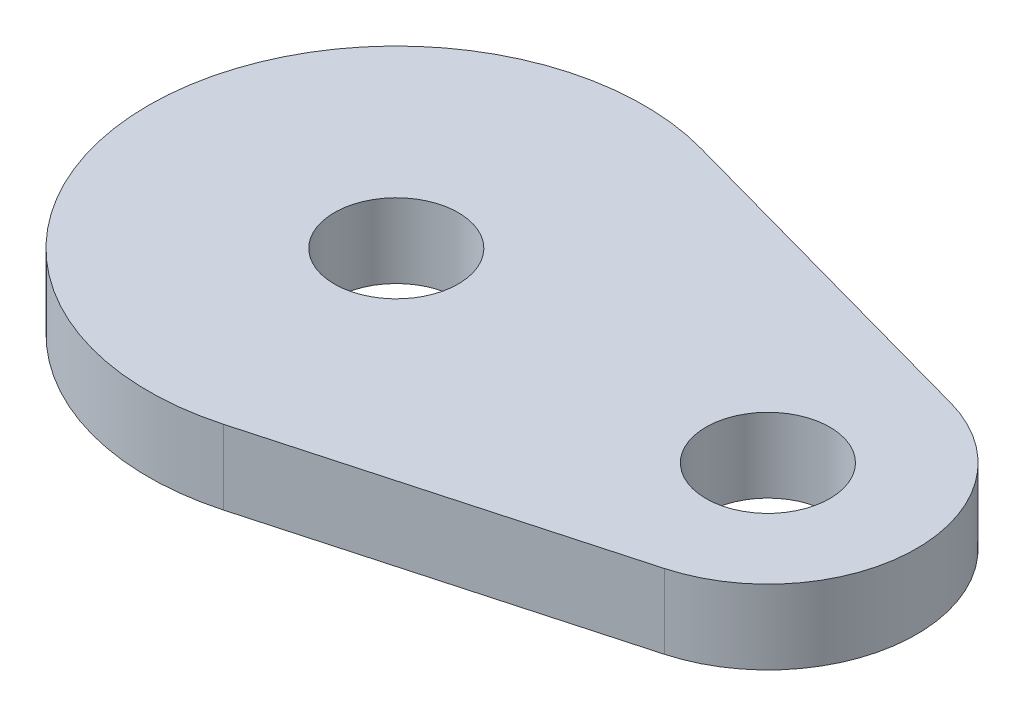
ISO-10303-21;
HEADER;
FILE_DESCRIPTION(('STEP AP214'),'2;1');
FILE_NAME('part.step','',(''),(''),'','','');
FILE_SCHEMA(('AUTOMOTIVE_DESIGN { 1 0 10303 214 1 1 1 1 }'));
ENDSEC;
DATA;
#1=APPLICATION_CONTEXT('core data for automotive mechanical design processes');
#2=APPLICATION_PROTOCOL_DEFINITION('international standard','automotive_design',2000,#1);
#3=PRODUCT_CONTEXT('',#1,'mechanical');
#4=PRODUCT('Part','Part','',(#3));
#5=PRODUCT_RELATED_PRODUCT_CATEGORY('part','',(#4));
#6=PRODUCT_DEFINITION_FORMATION('','',#4);
#7=PRODUCT_DEFINITION_CONTEXT('part definition',#1,'design');
#8=PRODUCT_DEFINITION('design','',#6,#7);
#9=PRODUCT_DEFINITION_SHAPE('','',#8);
#10=(LENGTH_UNIT() NAMED_UNIT(*) SI_UNIT(.MILLI.,.METRE.));
#11=(NAMED_UNIT(*) PLANE_ANGLE_UNIT() SI_UNIT($,.RADIAN.));
#12=(NAMED_UNIT(*) SI_UNIT($,.STERADIAN.) SOLID_ANGLE_UNIT());
#13=UNCERTAINTY_MEASURE_WITH_UNIT(LENGTH_MEASURE(1.E-05),#10,'distance_accuracy_value','');
#14=(GEOMETRIC_REPRESENTATION_CONTEXT(3) GLOBAL_UNCERTAINTY_ASSIGNED_CONTEXT((#13)) GLOBAL_UNIT_ASSIGNED_CONTEXT((#10,
#11,#12)) REPRESENTATION_CONTEXT('',''));
#15=CARTESIAN_POINT('',(0.,0.,0.));
#16=DIRECTION('',(0.,0.,1.));
#17=DIRECTION('',(1.,0.,0.));
#18=AXIS2_PLACEMENT_3D('',#15,#16,#17);
#19=CARTESIAN_POINT('',(0.,3.,0.));
#20=DIRECTION('',(0.,1.,0.));
#21=DIRECTION('',(0.,0.,1.));
#22=AXIS2_PLACEMENT_3D('',#19,#20,#21);
#23=PLANE('',#22);
#24=CARTESIAN_POINT('',(15.,3.,0.));
#25=DIRECTION('',(0.,1.,0.));
#26=DIRECTION('',(0.,0.,1.));
#27=AXIS2_PLACEMENT_3D('',#24,#25,#26);
#28=CIRCLE('',#27,2.5);
#29=CARTESIAN_POINT('',(15.,3.,2.5));
#30=VERTEX_POINT('',#29);
#31=EDGE_CURVE('E91',#30,#30,#28,.T.);
#32=ORIENTED_EDGE('',*,*,#31,.F.);
#33=EDGE_LOOP('',(#32));
#34=FACE_BOUND('',#33,.T.);
#35=CARTESIAN_POINT('',(0.,3.,0.));
#36=DIRECTION('',(0.,1.,0.));
#37=DIRECTION('',(0.,0.,1.));
#38=AXIS2_PLACEMENT_3D('',#35,#36,#37);
#39=CIRCLE('',#38,10.);
#40=CARTESIAN_POINT('',(2.66666666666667,3.,-9.63788819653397));
#41=VERTEX_POINT('',#40);
#42=CARTESIAN_POINT('',(2.66666666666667,3.,9.63788819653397));
#43=VERTEX_POINT('',#42);
#44=EDGE_CURVE('E101',#41,#43,#39,.T.);
#45=ORIENTED_EDGE('',*,*,#44,.T.);
#46=DIRECTION('',(0.963788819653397,0.,-0.266666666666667));
#47=VECTOR('',#46,1.);
#48=CARTESIAN_POINT('',(2.66666666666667,3.,9.63788819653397));
#49=LINE('',#48,#47);
#50=CARTESIAN_POINT('',(16.6,3.,5.78273291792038));
#51=VERTEX_POINT('',#50);
#52=EDGE_CURVE('E86',#43,#51,#49,.T.);
#53=ORIENTED_EDGE('',*,*,#52,.T.);
#54=CARTESIAN_POINT('',(15.,3.,0.));
#55=DIRECTION('',(0.,1.,0.));
#56=DIRECTION('',(0.,0.,1.));
#57=AXIS2_PLACEMENT_3D('',#54,#55,#56);
#58=CIRCLE('',#57,6.);
#59=CARTESIAN_POINT('',(16.6,3.,-5.78273291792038));
#60=VERTEX_POINT('',#59);
#61=EDGE_CURVE('E52',#51,#60,#58,.T.);
#62=ORIENTED_EDGE('',*,*,#61,.T.);
#63=DIRECTION('',(-0.963788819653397,0.,-0.266666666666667));
#64=VECTOR('',#63,1.);
#65=CARTESIAN_POINT('',(2.66666666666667,3.,-9.63788819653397));
#66=LINE('',#65,#64);
#67=EDGE_CURVE('E47',#60,#41,#66,.T.);
#68=ORIENTED_EDGE('',*,*,#67,.T.);
#69=EDGE_LOOP('',(#45,#53,#62,#68));
#70=FACE_BOUND('',#69,.T.);
#71=CARTESIAN_POINT('',(0.,3.,0.));
#72=DIRECTION('',(0.,1.,0.));
#73=DIRECTION('',(0.,0.,1.));
#74=AXIS2_PLACEMENT_3D('',#71,#72,#73);
#75=CIRCLE('',#74,2.5);
#76=CARTESIAN_POINT('',(0.,3.,2.5));
#77=VERTEX_POINT('',#76);
#78=EDGE_CURVE('E119',#77,#77,#75,.T.);
#79=ORIENTED_EDGE('',*,*,#78,.F.);
#80=EDGE_LOOP('',(#79));
#81=FACE_BOUND('',#80,.T.);
#82=ADVANCED_FACE('F32',(#34,#70,#81),#23,.T.);
#83=CARTESIAN_POINT('',(0.,0.,0.));
#84=DIRECTION('',(0.,1.,0.));
#85=DIRECTION('',(0.,0.,1.));
#86=AXIS2_PLACEMENT_3D('',#83,#84,#85);
#87=PLANE('',#86);
#88=CARTESIAN_POINT('',(15.,0.,0.));
#89=DIRECTION('',(0.,1.,0.));
#90=DIRECTION('',(0.,0.,1.));
#91=AXIS2_PLACEMENT_3D('',#88,#89,#90);
#92=CIRCLE('',#91,2.5);
#93=CARTESIAN_POINT('',(15.,0.,2.5));
#94=VERTEX_POINT('',#93);
#95=EDGE_CURVE('E94',#94,#94,#92,.T.);
#96=ORIENTED_EDGE('',*,*,#95,.T.);
#97=EDGE_LOOP('',(#96));
#98=FACE_BOUND('',#97,.T.);
#99=CARTESIAN_POINT('',(0.,0.,0.));
#100=DIRECTION('',(0.,1.,0.));
#101=DIRECTION('',(0.,0.,1.));
#102=AXIS2_PLACEMENT_3D('',#99,#100,#101);
#103=CIRCLE('',#102,10.);
#104=CARTESIAN_POINT('',(2.66666666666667,0.,-9.63788819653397));
#105=VERTEX_POINT('',#104);
#106=CARTESIAN_POINT('',(2.66666666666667,0.,9.63788819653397));
#107=VERTEX_POINT('',#106);
#108=EDGE_CURVE('E78',#105,#107,#103,.T.);
#109=ORIENTED_EDGE('',*,*,#108,.F.);
#110=DIRECTION('',(-0.963788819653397,0.,-0.266666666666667));
#111=VECTOR('',#110,1.);
#112=CARTESIAN_POINT('',(2.66666666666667,0.,-9.63788819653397));
#113=LINE('',#112,#111);
#114=CARTESIAN_POINT('',(16.6,0.,-5.78273291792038));
#115=VERTEX_POINT('',#114);
#116=EDGE_CURVE('E99',#115,#105,#113,.T.);
#117=ORIENTED_EDGE('',*,*,#116,.F.);
#118=CARTESIAN_POINT('',(15.,0.,0.));
#119=DIRECTION('',(0.,1.,0.));
#120=DIRECTION('',(0.,0.,1.));
#121=AXIS2_PLACEMENT_3D('',#118,#119,#120);
#122=CIRCLE('',#121,6.);
#123=CARTESIAN_POINT('',(16.6,0.,5.78273291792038));
#124=VERTEX_POINT('',#123);
#125=EDGE_CURVE('E79',#124,#115,#122,.T.);
#126=ORIENTED_EDGE('',*,*,#125,.F.);
#127=DIRECTION('',(0.963788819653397,0.,-0.266666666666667));
#128=VECTOR('',#127,1.);
#129=CARTESIAN_POINT('',(2.66666666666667,0.,9.63788819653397));
#130=LINE('',#129,#128);
#131=EDGE_CURVE('E73',#107,#124,#130,.T.);
#132=ORIENTED_EDGE('',*,*,#131,.F.);
#133=EDGE_LOOP('',(#109,#117,#126,#132));
#134=FACE_BOUND('',#133,.T.);
#135=CARTESIAN_POINT('',(0.,0.,0.));
#136=DIRECTION('',(0.,1.,0.));
#137=DIRECTION('',(0.,0.,1.));
#138=AXIS2_PLACEMENT_3D('',#135,#136,#137);
#139=CIRCLE('',#138,2.5);
#140=CARTESIAN_POINT('',(0.,0.,2.5));
#141=VERTEX_POINT('',#140);
#142=EDGE_CURVE('E121',#141,#141,#139,.T.);
#143=ORIENTED_EDGE('',*,*,#142,.T.);
#144=EDGE_LOOP('',(#143));
#145=FACE_BOUND('',#144,.T.);
#146=ADVANCED_FACE('F74',(#98,#134,#145),#87,.F.);
#147=CARTESIAN_POINT('',(0.,3.,0.));
#148=DIRECTION('',(0.,-1.,0.));
#149=DIRECTION('',(0.,0.,-1.));
#150=AXIS2_PLACEMENT_3D('',#147,#148,#149);
#151=CYLINDRICAL_SURFACE('',#150,10.);
#152=ORIENTED_EDGE('',*,*,#108,.T.);
#153=DIRECTION('',(0.,-1.,0.));
#154=VECTOR('',#153,1.);
#155=CARTESIAN_POINT('',(2.66666666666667,3.,9.63788819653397));
#156=LINE('',#155,#154);
#157=EDGE_CURVE('E11',#43,#107,#156,.T.);
#158=ORIENTED_EDGE('',*,*,#157,.F.);
#159=ORIENTED_EDGE('',*,*,#44,.F.);
#160=DIRECTION('',(0.,-1.,0.));
#161=VECTOR('',#160,1.);
#162=CARTESIAN_POINT('',(2.66666666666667,3.,-9.63788819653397));
#163=LINE('',#162,#161);
#164=EDGE_CURVE('E90',#41,#105,#163,.T.);
#165=ORIENTED_EDGE('',*,*,#164,.T.);
#166=EDGE_LOOP('',(#152,#158,#159,#165));
#167=FACE_BOUND('',#166,.T.);
#168=ADVANCED_FACE('F34',(#167),#151,.T.);
#169=CARTESIAN_POINT('',(2.66666666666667,3.,9.63788819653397));
#170=DIRECTION('',(-0.266666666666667,0.,-0.963788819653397));
#171=DIRECTION('',(-0.963788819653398,0.,0.266666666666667));
#172=AXIS2_PLACEMENT_3D('',#169,#170,#171);
#173=PLANE('',#172);
#174=ORIENTED_EDGE('',*,*,#131,.T.);
#175=DIRECTION('',(0.,-1.,0.));
#176=VECTOR('',#175,1.);
#177=CARTESIAN_POINT('',(16.6,3.,5.78273291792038));
#178=LINE('',#177,#176);
#179=EDGE_CURVE('E40',#51,#124,#178,.T.);
#180=ORIENTED_EDGE('',*,*,#179,.F.);
#181=ORIENTED_EDGE('',*,*,#52,.F.);
#182=ORIENTED_EDGE('',*,*,#157,.T.);
#183=EDGE_LOOP('',(#174,#180,#181,#182));
#184=FACE_BOUND('',#183,.T.);
#185=ADVANCED_FACE('F85',(#184),#173,.F.);
#186=CARTESIAN_POINT('',(15.,3.,0.));
#187=DIRECTION('',(0.,-1.,0.));
#188=DIRECTION('',(0.,0.,-1.));
#189=AXIS2_PLACEMENT_3D('',#186,#187,#188);
#190=CYLINDRICAL_SURFACE('',#189,6.);
#191=ORIENTED_EDGE('',*,*,#125,.T.);
#192=DIRECTION('',(0.,-1.,0.));
#193=VECTOR('',#192,1.);
#194=CARTESIAN_POINT('',(16.6,3.,-5.78273291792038));
#195=LINE('',#194,#193);
#196=EDGE_CURVE('E107',#60,#115,#195,.T.);
#197=ORIENTED_EDGE('',*,*,#196,.F.);
#198=ORIENTED_EDGE('',*,*,#61,.F.);
#199=ORIENTED_EDGE('',*,*,#179,.T.);
#200=EDGE_LOOP('',(#191,#197,#198,#199));
#201=FACE_BOUND('',#200,.T.);
#202=ADVANCED_FACE('F110',(#201),#190,.T.);
#203=CARTESIAN_POINT('',(2.66666666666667,3.,-9.63788819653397));
#204=DIRECTION('',(-0.266666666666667,0.,0.963788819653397));
#205=DIRECTION('',(0.963788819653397,0.,0.266666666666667));
#206=AXIS2_PLACEMENT_3D('',#203,#204,#205);
#207=PLANE('',#206);
#208=ORIENTED_EDGE('',*,*,#116,.T.);
#209=ORIENTED_EDGE('',*,*,#164,.F.);
#210=ORIENTED_EDGE('',*,*,#67,.F.);
#211=ORIENTED_EDGE('',*,*,#196,.T.);
#212=EDGE_LOOP('',(#208,#209,#210,#211));
#213=FACE_BOUND('',#212,.T.);
#214=ADVANCED_FACE('F112',(#213),#207,.F.);
#215=CARTESIAN_POINT('',(15.,3.,0.));
#216=DIRECTION('',(0.,-1.,0.));
#217=DIRECTION('',(0.,0.,-1.));
#218=AXIS2_PLACEMENT_3D('',#215,#216,#217);
#219=CYLINDRICAL_SURFACE('',#218,2.5);
#220=ORIENTED_EDGE('',*,*,#31,.T.);
#221=EDGE_LOOP('',(#220));
#222=FACE_BOUND('',#221,.T.);
#223=ORIENTED_EDGE('',*,*,#95,.F.);
#224=EDGE_LOOP('',(#223));
#225=FACE_BOUND('',#224,.T.);
#226=ADVANCED_FACE('F130',(#222,#225),#219,.F.);
#227=CARTESIAN_POINT('',(0.,3.,0.));
#228=DIRECTION('',(0.,-1.,0.));
#229=DIRECTION('',(0.,0.,-1.));
#230=AXIS2_PLACEMENT_3D('',#227,#228,#229);
#231=CYLINDRICAL_SURFACE('',#230,2.5);
#232=ORIENTED_EDGE('',*,*,#78,.T.);
#233=EDGE_LOOP('',(#232));
#234=FACE_BOUND('',#233,.T.);
#235=ORIENTED_EDGE('',*,*,#142,.F.);
#236=EDGE_LOOP('',(#235));
#237=FACE_BOUND('',#236,.T.);
#238=ADVANCED_FACE('F128',(#234,#237),#231,.F.);
#239=CLOSED_SHELL('',(#82,#146,#168,#185,#202,#214,#226,#238));
#240=MANIFOLD_SOLID_BREP('B2',#239);
#241=ADVANCED_BREP_SHAPE_REPRESENTATION('',(#18,#240),#14);
#242=SHAPE_DEFINITION_REPRESENTATION(#9,#241);
ENDSEC;
END-ISO-10303-21;
